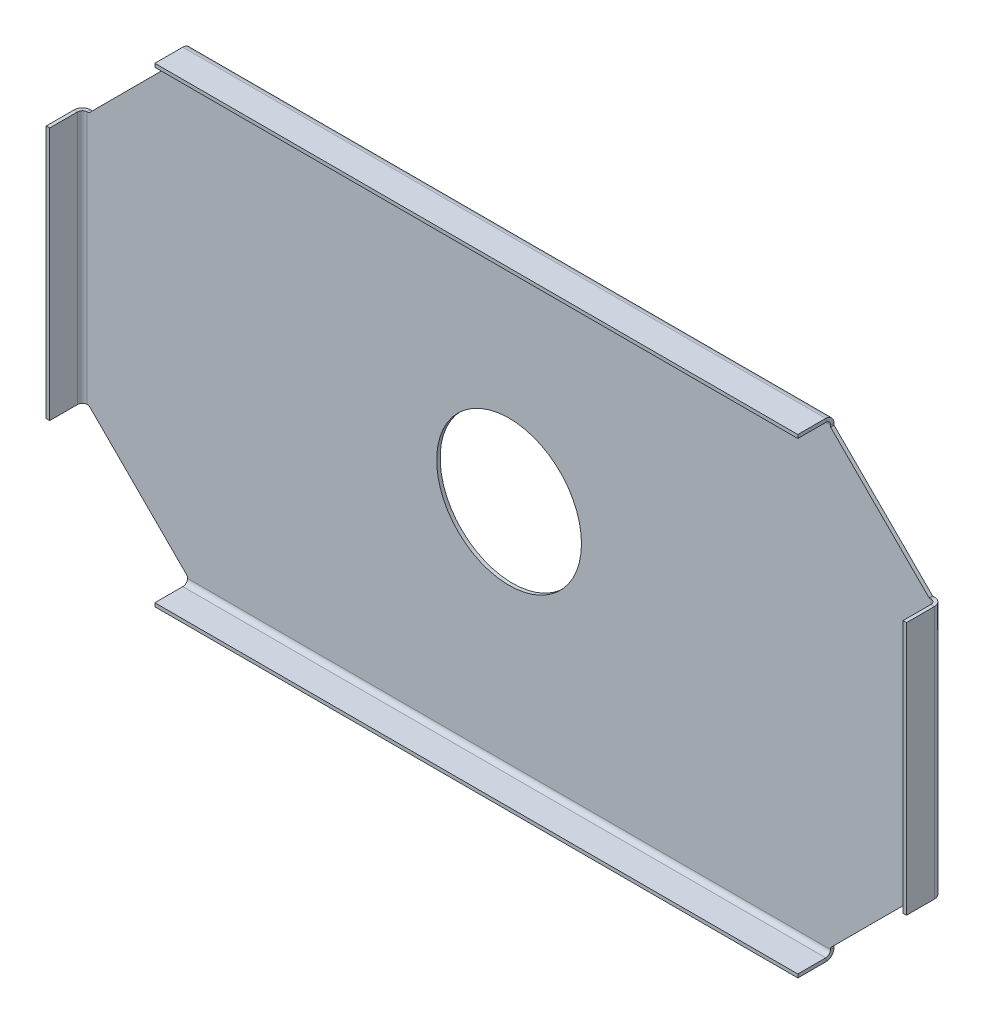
ISO-10303-21;
HEADER;
FILE_DESCRIPTION(('STEP AP214'),'2;1');
FILE_NAME('part.step','',(''),(''),'','','');
FILE_SCHEMA(('AUTOMOTIVE_DESIGN { 1 0 10303 214 1 1 1 1 }'));
ENDSEC;
DATA;
#1=APPLICATION_CONTEXT('core data for automotive mechanical design processes');
#2=APPLICATION_PROTOCOL_DEFINITION('international standard','automotive_design',2000,#1);
#3=PRODUCT_CONTEXT('',#1,'mechanical');
#4=PRODUCT('Part','Part','',(#3));
#5=PRODUCT_RELATED_PRODUCT_CATEGORY('part','',(#4));
#6=PRODUCT_DEFINITION_FORMATION('','',#4);
#7=PRODUCT_DEFINITION_CONTEXT('part definition',#1,'design');
#8=PRODUCT_DEFINITION('design','',#6,#7);
#9=PRODUCT_DEFINITION_SHAPE('','',#8);
#10=(LENGTH_UNIT() NAMED_UNIT(*) SI_UNIT(.MILLI.,.METRE.));
#11=(NAMED_UNIT(*) PLANE_ANGLE_UNIT() SI_UNIT($,.RADIAN.));
#12=(NAMED_UNIT(*) SI_UNIT($,.STERADIAN.) SOLID_ANGLE_UNIT());
#13=UNCERTAINTY_MEASURE_WITH_UNIT(LENGTH_MEASURE(1.E-05),#10,'distance_accuracy_value','');
#14=(GEOMETRIC_REPRESENTATION_CONTEXT(3) GLOBAL_UNCERTAINTY_ASSIGNED_CONTEXT((#13)) GLOBAL_UNIT_ASSIGNED_CONTEXT((#10,
#11,#12)) REPRESENTATION_CONTEXT('',''));
#15=CARTESIAN_POINT('',(0.,0.,0.));
#16=DIRECTION('',(0.,0.,1.));
#17=DIRECTION('',(1.,0.,0.));
#18=AXIS2_PLACEMENT_3D('',#15,#16,#17);
#19=CARTESIAN_POINT('',(0.,0.,-1.2192));
#20=DIRECTION('',(0.,0.,1.));
#21=DIRECTION('',(1.,0.,0.));
#22=AXIS2_PLACEMENT_3D('',#19,#20,#21);
#23=PLANE('',#22);
#24=CARTESIAN_POINT('',(0.,0.,-1.21920000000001));
#25=DIRECTION('',(0.,0.,1.));
#26=DIRECTION('',(1.,0.,0.));
#27=AXIS2_PLACEMENT_3D('',#24,#25,#26);
#28=CIRCLE('',#27,25.4);
#29=CARTESIAN_POINT('',(25.4,0.,-1.21920000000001));
#30=VERTEX_POINT('',#29);
#31=EDGE_CURVE('E1112',#30,#30,#28,.T.);
#32=ORIENTED_EDGE('',*,*,#31,.T.);
#33=EDGE_LOOP('',(#32));
#34=FACE_BOUND('',#33,.T.);
#35=DIRECTION('',(0.,-1.,0.));
#36=VECTOR('',#35,1.);
#37=CARTESIAN_POINT('',(-112.776,0.,-1.2192));
#38=LINE('',#37,#36);
#39=CARTESIAN_POINT('',(-112.776,-79.0448,-1.21920000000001));
#40=VERTEX_POINT('',#39);
#41=CARTESIAN_POINT('',(-112.776,-79.6544,-1.2192));
#42=VERTEX_POINT('',#41);
#43=EDGE_CURVE('E415',#40,#42,#38,.T.);
#44=ORIENTED_EDGE('',*,*,#43,.F.);
#45=DIRECTION('',(-0.707106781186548,0.707106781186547,0.));
#46=VECTOR('',#45,1.);
#47=CARTESIAN_POINT('',(-147.3708,-44.4499999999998,-1.21920000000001));
#48=LINE('',#47,#46);
#49=CARTESIAN_POINT('',(-147.3708,-44.4499999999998,-1.21920000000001));
#50=VERTEX_POINT('',#49);
#51=EDGE_CURVE('E437',#40,#50,#48,.T.);
#52=ORIENTED_EDGE('',*,*,#51,.T.);
#53=DIRECTION('',(1.,0.,0.));
#54=VECTOR('',#53,1.);
#55=CARTESIAN_POINT('',(0.,-44.4499999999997,-1.2192));
#56=LINE('',#55,#54);
#57=CARTESIAN_POINT('',(-147.9804,-44.4499999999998,-1.2192));
#58=VERTEX_POINT('',#57);
#59=EDGE_CURVE('E409',#58,#50,#56,.T.);
#60=ORIENTED_EDGE('',*,*,#59,.F.);
#61=DIRECTION('',(0.,-1.,0.));
#62=VECTOR('',#61,1.);
#63=CARTESIAN_POINT('',(-147.9804,-44.4499999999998,-1.2192));
#64=LINE('',#63,#62);
#65=CARTESIAN_POINT('',(-147.9804,44.4499999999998,-1.2192));
#66=VERTEX_POINT('',#65);
#67=EDGE_CURVE('E1210',#58,#66,#64,.F.);
#68=ORIENTED_EDGE('',*,*,#67,.T.);
#69=DIRECTION('',(-1.,0.,0.));
#70=VECTOR('',#69,1.);
#71=CARTESIAN_POINT('',(0.,44.4499999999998,-1.2192));
#72=LINE('',#71,#70);
#73=CARTESIAN_POINT('',(-147.3708,44.4499999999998,-1.21920000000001));
#74=VERTEX_POINT('',#73);
#75=EDGE_CURVE('E400',#74,#66,#72,.T.);
#76=ORIENTED_EDGE('',*,*,#75,.F.);
#77=DIRECTION('',(0.707106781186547,0.707106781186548,0.));
#78=VECTOR('',#77,1.);
#79=CARTESIAN_POINT('',(-147.3708,44.4499999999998,-1.21920000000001));
#80=LINE('',#79,#78);
#81=CARTESIAN_POINT('',(-112.776,79.0448,-1.21920000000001));
#82=VERTEX_POINT('',#81);
#83=EDGE_CURVE('E345',#74,#82,#80,.T.);
#84=ORIENTED_EDGE('',*,*,#83,.T.);
#85=DIRECTION('',(0.,-1.,0.));
#86=VECTOR('',#85,1.);
#87=CARTESIAN_POINT('',(-112.776,0.,-1.2192));
#88=LINE('',#87,#86);
#89=CARTESIAN_POINT('',(-112.776,79.6544000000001,-1.21919999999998));
#90=VERTEX_POINT('',#89);
#91=EDGE_CURVE('E394',#90,#82,#88,.T.);
#92=ORIENTED_EDGE('',*,*,#91,.F.);
#93=DIRECTION('',(-1.,0.,0.));
#94=VECTOR('',#93,1.);
#95=CARTESIAN_POINT('',(-112.776,79.6544000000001,-1.21919999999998));
#96=LINE('',#95,#94);
#97=CARTESIAN_POINT('',(112.776,79.6544000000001,-1.2192));
#98=VERTEX_POINT('',#97);
#99=EDGE_CURVE('E1157',#90,#98,#96,.F.);
#100=ORIENTED_EDGE('',*,*,#99,.T.);
#101=DIRECTION('',(0.,1.,0.));
#102=VECTOR('',#101,1.);
#103=CARTESIAN_POINT('',(112.776,0.,-1.2192));
#104=LINE('',#103,#102);
#105=CARTESIAN_POINT('',(112.776,79.0448000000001,-1.2192));
#106=VERTEX_POINT('',#105);
#107=EDGE_CURVE('E344',#106,#98,#104,.T.);
#108=ORIENTED_EDGE('',*,*,#107,.F.);
#109=DIRECTION('',(0.707106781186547,-0.707106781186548,0.));
#110=VECTOR('',#109,1.);
#111=CARTESIAN_POINT('',(112.776,79.0448,-1.21920000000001));
#112=LINE('',#111,#110);
#113=CARTESIAN_POINT('',(147.3708,44.4499999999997,-1.21920000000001));
#114=VERTEX_POINT('',#113);
#115=EDGE_CURVE('E330',#106,#114,#112,.T.);
#116=ORIENTED_EDGE('',*,*,#115,.T.);
#117=DIRECTION('',(-1.,0.,0.));
#118=VECTOR('',#117,1.);
#119=CARTESIAN_POINT('',(0.,44.4499999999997,-1.2192));
#120=LINE('',#119,#118);
#121=CARTESIAN_POINT('',(147.9804,44.4499999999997,-1.2192));
#122=VERTEX_POINT('',#121);
#123=EDGE_CURVE('E13',#122,#114,#120,.T.);
#124=ORIENTED_EDGE('',*,*,#123,.F.);
#125=DIRECTION('',(0.,1.,0.));
#126=VECTOR('',#125,1.);
#127=CARTESIAN_POINT('',(147.9804,44.4499999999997,-1.2192));
#128=LINE('',#127,#126);
#129=CARTESIAN_POINT('',(147.9804,-44.4499999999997,-1.2192));
#130=VERTEX_POINT('',#129);
#131=EDGE_CURVE('E361',#122,#130,#128,.F.);
#132=ORIENTED_EDGE('',*,*,#131,.T.);
#133=DIRECTION('',(1.,0.,0.));
#134=VECTOR('',#133,1.);
#135=CARTESIAN_POINT('',(0.,-44.4499999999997,-1.2192));
#136=LINE('',#135,#134);
#137=CARTESIAN_POINT('',(147.3708,-44.4499999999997,-1.21920000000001));
#138=VERTEX_POINT('',#137);
#139=EDGE_CURVE('E127',#138,#130,#136,.T.);
#140=ORIENTED_EDGE('',*,*,#139,.F.);
#141=DIRECTION('',(-0.707106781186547,-0.707106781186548,0.));
#142=VECTOR('',#141,1.);
#143=CARTESIAN_POINT('',(112.776,-79.0448,-1.21920000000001));
#144=LINE('',#143,#142);
#145=CARTESIAN_POINT('',(112.776,-79.0448,-1.21920000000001));
#146=VERTEX_POINT('',#145);
#147=EDGE_CURVE('E346',#138,#146,#144,.T.);
#148=ORIENTED_EDGE('',*,*,#147,.T.);
#149=DIRECTION('',(0.,1.,0.));
#150=VECTOR('',#149,1.);
#151=CARTESIAN_POINT('',(112.776,0.,-1.2192));
#152=LINE('',#151,#150);
#153=CARTESIAN_POINT('',(112.776,-79.6544,-1.21919999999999));
#154=VERTEX_POINT('',#153);
#155=EDGE_CURVE('E424',#154,#146,#152,.T.);
#156=ORIENTED_EDGE('',*,*,#155,.F.);
#157=DIRECTION('',(1.,0.,0.));
#158=VECTOR('',#157,1.);
#159=CARTESIAN_POINT('',(112.776,-79.6544,-1.21919999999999));
#160=LINE('',#159,#158);
#161=EDGE_CURVE('E456',#154,#42,#160,.F.);
#162=ORIENTED_EDGE('',*,*,#161,.T.);
#163=EDGE_LOOP('',(#44,#52,#60,#68,#76,#84,#92,#100,#108,#116,#124,#132,#140,#148,#156,#162));
#164=FACE_BOUND('',#163,.T.);
#165=ADVANCED_FACE('F118',(#34,#164),#23,.F.);
#166=CARTESIAN_POINT('',(0.,0.,0.));
#167=DIRECTION('',(0.,0.,1.));
#168=DIRECTION('',(1.,0.,0.));
#169=AXIS2_PLACEMENT_3D('',#166,#167,#168);
#170=PLANE('',#169);
#171=CARTESIAN_POINT('',(0.,0.,0.));
#172=DIRECTION('',(0.,0.,1.));
#173=DIRECTION('',(1.,0.,0.));
#174=AXIS2_PLACEMENT_3D('',#171,#172,#173);
#175=CIRCLE('',#174,25.4);
#176=CARTESIAN_POINT('',(25.4,0.,0.));
#177=VERTEX_POINT('',#176);
#178=EDGE_CURVE('E122',#177,#177,#175,.T.);
#179=ORIENTED_EDGE('',*,*,#178,.F.);
#180=EDGE_LOOP('',(#179));
#181=FACE_BOUND('',#180,.T.);
#182=DIRECTION('',(-0.707106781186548,0.707106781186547,0.));
#183=VECTOR('',#182,1.);
#184=CARTESIAN_POINT('',(-95.9103999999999,-95.9103999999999,0.));
#185=LINE('',#184,#183);
#186=CARTESIAN_POINT('',(-112.776,-79.0448,0.));
#187=VERTEX_POINT('',#186);
#188=CARTESIAN_POINT('',(-147.3708,-44.4499999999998,0.));
#189=VERTEX_POINT('',#188);
#190=EDGE_CURVE('E1122',#187,#189,#185,.T.);
#191=ORIENTED_EDGE('',*,*,#190,.F.);
#192=DIRECTION('',(0.,1.,0.));
#193=VECTOR('',#192,1.);
#194=CARTESIAN_POINT('',(-112.776,-79.6544,0.));
#195=LINE('',#194,#193);
#196=CARTESIAN_POINT('',(-112.776,-79.6544,0.));
#197=VERTEX_POINT('',#196);
#198=EDGE_CURVE('E417',#197,#187,#195,.T.);
#199=ORIENTED_EDGE('',*,*,#198,.F.);
#200=DIRECTION('',(1.,0.,0.));
#201=VECTOR('',#200,1.);
#202=CARTESIAN_POINT('',(112.776,-79.6544,0.));
#203=LINE('',#202,#201);
#204=CARTESIAN_POINT('',(112.776,-79.6544,0.));
#205=VERTEX_POINT('',#204);
#206=EDGE_CURVE('E470',#205,#197,#203,.F.);
#207=ORIENTED_EDGE('',*,*,#206,.F.);
#208=DIRECTION('',(0.,-1.,0.));
#209=VECTOR('',#208,1.);
#210=CARTESIAN_POINT('',(112.776,-79.0448,0.));
#211=LINE('',#210,#209);
#212=CARTESIAN_POINT('',(112.776,-79.0448,0.));
#213=VERTEX_POINT('',#212);
#214=EDGE_CURVE('E413',#213,#205,#211,.T.);
#215=ORIENTED_EDGE('',*,*,#214,.F.);
#216=DIRECTION('',(-0.707106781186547,-0.707106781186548,0.));
#217=VECTOR('',#216,1.);
#218=CARTESIAN_POINT('',(95.9103999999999,-95.9103999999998,0.));
#219=LINE('',#218,#217);
#220=CARTESIAN_POINT('',(147.3708,-44.4499999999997,0.));
#221=VERTEX_POINT('',#220);
#222=EDGE_CURVE('E1124',#221,#213,#219,.T.);
#223=ORIENTED_EDGE('',*,*,#222,.F.);
#224=DIRECTION('',(-1.,0.,0.));
#225=VECTOR('',#224,1.);
#226=CARTESIAN_POINT('',(147.9804,-44.4499999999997,0.));
#227=LINE('',#226,#225);
#228=CARTESIAN_POINT('',(147.9804,-44.4499999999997,0.));
#229=VERTEX_POINT('',#228);
#230=EDGE_CURVE('E337',#229,#221,#227,.T.);
#231=ORIENTED_EDGE('',*,*,#230,.F.);
#232=DIRECTION('',(0.,1.,0.));
#233=VECTOR('',#232,1.);
#234=CARTESIAN_POINT('',(147.9804,44.4499999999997,0.));
#235=LINE('',#234,#233);
#236=CARTESIAN_POINT('',(147.9804,44.4499999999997,0.));
#237=VERTEX_POINT('',#236);
#238=EDGE_CURVE('E374',#237,#229,#235,.F.);
#239=ORIENTED_EDGE('',*,*,#238,.F.);
#240=DIRECTION('',(1.,0.,0.));
#241=VECTOR('',#240,1.);
#242=CARTESIAN_POINT('',(147.3708,44.4499999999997,0.));
#243=LINE('',#242,#241);
#244=CARTESIAN_POINT('',(147.3708,44.4499999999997,0.));
#245=VERTEX_POINT('',#244);
#246=EDGE_CURVE('E336',#245,#237,#243,.T.);
#247=ORIENTED_EDGE('',*,*,#246,.F.);
#248=DIRECTION('',(0.707106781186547,-0.707106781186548,0.));
#249=VECTOR('',#248,1.);
#250=CARTESIAN_POINT('',(95.9104,95.9103999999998,0.));
#251=LINE('',#250,#249);
#252=CARTESIAN_POINT('',(112.776,79.0448,0.));
#253=VERTEX_POINT('',#252);
#254=EDGE_CURVE('E333',#253,#245,#251,.T.);
#255=ORIENTED_EDGE('',*,*,#254,.F.);
#256=DIRECTION('',(0.,-1.,0.));
#257=VECTOR('',#256,1.);
#258=CARTESIAN_POINT('',(112.776,79.6544,0.));
#259=LINE('',#258,#257);
#260=CARTESIAN_POINT('',(112.776,79.6544,0.));
#261=VERTEX_POINT('',#260);
#262=EDGE_CURVE('E388',#261,#253,#259,.T.);
#263=ORIENTED_EDGE('',*,*,#262,.F.);
#264=DIRECTION('',(-1.,0.,0.));
#265=VECTOR('',#264,1.);
#266=CARTESIAN_POINT('',(-112.776,79.6544,0.));
#267=LINE('',#266,#265);
#268=CARTESIAN_POINT('',(-112.776,79.6544,0.));
#269=VERTEX_POINT('',#268);
#270=EDGE_CURVE('E1169',#269,#261,#267,.F.);
#271=ORIENTED_EDGE('',*,*,#270,.F.);
#272=DIRECTION('',(0.,1.,0.));
#273=VECTOR('',#272,1.);
#274=CARTESIAN_POINT('',(-112.776,79.0448,0.));
#275=LINE('',#274,#273);
#276=CARTESIAN_POINT('',(-112.776,79.0448,0.));
#277=VERTEX_POINT('',#276);
#278=EDGE_CURVE('E385',#277,#269,#275,.T.);
#279=ORIENTED_EDGE('',*,*,#278,.F.);
#280=DIRECTION('',(0.707106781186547,0.707106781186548,0.));
#281=VECTOR('',#280,1.);
#282=CARTESIAN_POINT('',(-95.9103999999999,95.9103999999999,0.));
#283=LINE('',#282,#281);
#284=CARTESIAN_POINT('',(-147.3708,44.4499999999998,0.));
#285=VERTEX_POINT('',#284);
#286=EDGE_CURVE('E1120',#285,#277,#283,.T.);
#287=ORIENTED_EDGE('',*,*,#286,.F.);
#288=DIRECTION('',(1.,0.,0.));
#289=VECTOR('',#288,1.);
#290=CARTESIAN_POINT('',(-147.9804,44.4499999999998,0.));
#291=LINE('',#290,#289);
#292=CARTESIAN_POINT('',(-147.9804,44.4499999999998,0.));
#293=VERTEX_POINT('',#292);
#294=EDGE_CURVE('E402',#293,#285,#291,.T.);
#295=ORIENTED_EDGE('',*,*,#294,.F.);
#296=DIRECTION('',(0.,-1.,0.));
#297=VECTOR('',#296,1.);
#298=CARTESIAN_POINT('',(-147.9804,-44.4499999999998,0.));
#299=LINE('',#298,#297);
#300=CARTESIAN_POINT('',(-147.9804,-44.4499999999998,0.));
#301=VERTEX_POINT('',#300);
#302=EDGE_CURVE('E1223',#301,#293,#299,.F.);
#303=ORIENTED_EDGE('',*,*,#302,.F.);
#304=DIRECTION('',(-1.,0.,0.));
#305=VECTOR('',#304,1.);
#306=CARTESIAN_POINT('',(-147.3708,-44.4499999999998,0.));
#307=LINE('',#306,#305);
#308=EDGE_CURVE('E398',#189,#301,#307,.T.);
#309=ORIENTED_EDGE('',*,*,#308,.F.);
#310=EDGE_LOOP('',(#191,#199,#207,#215,#223,#231,#239,#247,#255,#263,#271,#279,#287,#295,#303,#309));
#311=FACE_BOUND('',#310,.T.);
#312=ADVANCED_FACE('F120',(#181,#311),#170,.T.);
#313=CARTESIAN_POINT('',(147.3708,44.4499999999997,0.));
#314=DIRECTION('',(0.,1.,0.));
#315=DIRECTION('',(0.,0.,1.));
#316=AXIS2_PLACEMENT_3D('',#313,#314,#315);
#317=PLANE('',#316);
#318=DIRECTION('',(0.,0.,-1.));
#319=VECTOR('',#318,1.);
#320=CARTESIAN_POINT('',(147.9804,44.4499999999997,0.));
#321=LINE('',#320,#319);
#322=EDGE_CURVE('E350',#237,#122,#321,.T.);
#323=ORIENTED_EDGE('',*,*,#322,.T.);
#324=ORIENTED_EDGE('',*,*,#123,.T.);
#325=DIRECTION('',(0.,0.,-1.));
#326=VECTOR('',#325,1.);
#327=CARTESIAN_POINT('',(147.3708,44.4499999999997,0.));
#328=LINE('',#327,#326);
#329=EDGE_CURVE('E327',#245,#114,#328,.T.);
#330=ORIENTED_EDGE('',*,*,#329,.F.);
#331=ORIENTED_EDGE('',*,*,#246,.T.);
#332=EDGE_LOOP('',(#323,#324,#330,#331));
#333=FACE_BOUND('',#332,.T.);
#334=ADVANCED_FACE('F348',(#333),#317,.T.);
#335=CARTESIAN_POINT('',(147.9804,-44.4499999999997,0.));
#336=DIRECTION('',(0.,-1.,0.));
#337=DIRECTION('',(0.,0.,-1.));
#338=AXIS2_PLACEMENT_3D('',#335,#336,#337);
#339=PLANE('',#338);
#340=DIRECTION('',(0.,0.,-1.));
#341=VECTOR('',#340,1.);
#342=CARTESIAN_POINT('',(147.3708,-44.4499999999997,0.));
#343=LINE('',#342,#341);
#344=EDGE_CURVE('E427',#221,#138,#343,.T.);
#345=ORIENTED_EDGE('',*,*,#344,.T.);
#346=ORIENTED_EDGE('',*,*,#139,.T.);
#347=DIRECTION('',(0.,0.,-1.));
#348=VECTOR('',#347,1.);
#349=CARTESIAN_POINT('',(147.9804,-44.4499999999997,0.));
#350=LINE('',#349,#348);
#351=EDGE_CURVE('E138',#229,#130,#350,.T.);
#352=ORIENTED_EDGE('',*,*,#351,.F.);
#353=ORIENTED_EDGE('',*,*,#230,.T.);
#354=EDGE_LOOP('',(#345,#346,#352,#353));
#355=FACE_BOUND('',#354,.T.);
#356=ADVANCED_FACE('F431',(#355),#339,.T.);
#357=CARTESIAN_POINT('',(112.776,-79.0448,0.));
#358=DIRECTION('',(1.,0.,0.));
#359=DIRECTION('',(0.,0.,-1.));
#360=AXIS2_PLACEMENT_3D('',#357,#358,#359);
#361=PLANE('',#360);
#362=DIRECTION('',(0.,0.,-1.));
#363=VECTOR('',#362,1.);
#364=CARTESIAN_POINT('',(112.776,-79.6544,0.));
#365=LINE('',#364,#363);
#366=EDGE_CURVE('E444',#205,#154,#365,.T.);
#367=ORIENTED_EDGE('',*,*,#366,.T.);
#368=ORIENTED_EDGE('',*,*,#155,.T.);
#369=DIRECTION('',(0.,0.,-1.));
#370=VECTOR('',#369,1.);
#371=CARTESIAN_POINT('',(112.776,-79.0448,0.));
#372=LINE('',#371,#370);
#373=EDGE_CURVE('E416',#213,#146,#372,.T.);
#374=ORIENTED_EDGE('',*,*,#373,.F.);
#375=ORIENTED_EDGE('',*,*,#214,.T.);
#376=EDGE_LOOP('',(#367,#368,#374,#375));
#377=FACE_BOUND('',#376,.T.);
#378=ADVANCED_FACE('F441',(#377),#361,.T.);
#379=CARTESIAN_POINT('',(-112.776,-79.6544,0.));
#380=DIRECTION('',(-1.,0.,0.));
#381=DIRECTION('',(0.,0.,1.));
#382=AXIS2_PLACEMENT_3D('',#379,#380,#381);
#383=PLANE('',#382);
#384=DIRECTION('',(0.,0.,-1.));
#385=VECTOR('',#384,1.);
#386=CARTESIAN_POINT('',(-112.776,-79.0448,0.));
#387=LINE('',#386,#385);
#388=EDGE_CURVE('E412',#187,#40,#387,.T.);
#389=ORIENTED_EDGE('',*,*,#388,.T.);
#390=ORIENTED_EDGE('',*,*,#43,.T.);
#391=DIRECTION('',(0.,0.,-1.));
#392=VECTOR('',#391,1.);
#393=CARTESIAN_POINT('',(-112.776,-79.6544,0.));
#394=LINE('',#393,#392);
#395=EDGE_CURVE('E451',#197,#42,#394,.T.);
#396=ORIENTED_EDGE('',*,*,#395,.F.);
#397=ORIENTED_EDGE('',*,*,#198,.T.);
#398=EDGE_LOOP('',(#389,#390,#396,#397));
#399=FACE_BOUND('',#398,.T.);
#400=ADVANCED_FACE('F552',(#399),#383,.T.);
#401=CARTESIAN_POINT('',(-147.3708,-44.4499999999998,0.));
#402=DIRECTION('',(0.,-1.,0.));
#403=DIRECTION('',(0.,0.,-1.));
#404=AXIS2_PLACEMENT_3D('',#401,#402,#403);
#405=PLANE('',#404);
#406=DIRECTION('',(0.,0.,-1.));
#407=VECTOR('',#406,1.);
#408=CARTESIAN_POINT('',(-147.9804,-44.4499999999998,0.));
#409=LINE('',#408,#407);
#410=EDGE_CURVE('E1217',#301,#58,#409,.T.);
#411=ORIENTED_EDGE('',*,*,#410,.T.);
#412=ORIENTED_EDGE('',*,*,#59,.T.);
#413=DIRECTION('',(0.,0.,-1.));
#414=VECTOR('',#413,1.);
#415=CARTESIAN_POINT('',(-147.3708,-44.4499999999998,0.));
#416=LINE('',#415,#414);
#417=EDGE_CURVE('E401',#189,#50,#416,.T.);
#418=ORIENTED_EDGE('',*,*,#417,.F.);
#419=ORIENTED_EDGE('',*,*,#308,.T.);
#420=EDGE_LOOP('',(#411,#412,#418,#419));
#421=FACE_BOUND('',#420,.T.);
#422=ADVANCED_FACE('F555',(#421),#405,.T.);
#423=CARTESIAN_POINT('',(-147.9804,44.4499999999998,0.));
#424=DIRECTION('',(0.,1.,0.));
#425=DIRECTION('',(0.,0.,1.));
#426=AXIS2_PLACEMENT_3D('',#423,#424,#425);
#427=PLANE('',#426);
#428=DIRECTION('',(0.,0.,-1.));
#429=VECTOR('',#428,1.);
#430=CARTESIAN_POINT('',(-147.3708,44.4499999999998,0.));
#431=LINE('',#430,#429);
#432=EDGE_CURVE('E397',#285,#74,#431,.T.);
#433=ORIENTED_EDGE('',*,*,#432,.T.);
#434=ORIENTED_EDGE('',*,*,#75,.T.);
#435=DIRECTION('',(0.,0.,-1.));
#436=VECTOR('',#435,1.);
#437=CARTESIAN_POINT('',(-147.9804,44.4499999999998,0.));
#438=LINE('',#437,#436);
#439=EDGE_CURVE('E1228',#293,#66,#438,.T.);
#440=ORIENTED_EDGE('',*,*,#439,.F.);
#441=ORIENTED_EDGE('',*,*,#294,.T.);
#442=EDGE_LOOP('',(#433,#434,#440,#441));
#443=FACE_BOUND('',#442,.T.);
#444=ADVANCED_FACE('F559',(#443),#427,.T.);
#445=CARTESIAN_POINT('',(-112.776,79.0448,0.));
#446=DIRECTION('',(-1.,0.,0.));
#447=DIRECTION('',(0.,0.,1.));
#448=AXIS2_PLACEMENT_3D('',#445,#446,#447);
#449=PLANE('',#448);
#450=DIRECTION('',(0.,0.,-1.));
#451=VECTOR('',#450,1.);
#452=CARTESIAN_POINT('',(-112.776,79.6544,0.));
#453=LINE('',#452,#451);
#454=EDGE_CURVE('E1163',#269,#90,#453,.T.);
#455=ORIENTED_EDGE('',*,*,#454,.T.);
#456=ORIENTED_EDGE('',*,*,#91,.T.);
#457=DIRECTION('',(0.,0.,-1.));
#458=VECTOR('',#457,1.);
#459=CARTESIAN_POINT('',(-112.776,79.0448,0.));
#460=LINE('',#459,#458);
#461=EDGE_CURVE('E387',#277,#82,#460,.T.);
#462=ORIENTED_EDGE('',*,*,#461,.F.);
#463=ORIENTED_EDGE('',*,*,#278,.T.);
#464=EDGE_LOOP('',(#455,#456,#462,#463));
#465=FACE_BOUND('',#464,.T.);
#466=ADVANCED_FACE('F563',(#465),#449,.T.);
#467=CARTESIAN_POINT('',(112.776,79.6544,0.));
#468=DIRECTION('',(1.,0.,0.));
#469=DIRECTION('',(0.,0.,-1.));
#470=AXIS2_PLACEMENT_3D('',#467,#468,#469);
#471=PLANE('',#470);
#472=DIRECTION('',(0.,0.,-1.));
#473=VECTOR('',#472,1.);
#474=CARTESIAN_POINT('',(112.776,79.0448,0.));
#475=LINE('',#474,#473);
#476=EDGE_CURVE('E383',#253,#106,#475,.T.);
#477=ORIENTED_EDGE('',*,*,#476,.T.);
#478=ORIENTED_EDGE('',*,*,#107,.T.);
#479=DIRECTION('',(0.,0.,-1.));
#480=VECTOR('',#479,1.);
#481=CARTESIAN_POINT('',(112.776,79.6544,0.));
#482=LINE('',#481,#480);
#483=EDGE_CURVE('E1174',#261,#98,#482,.T.);
#484=ORIENTED_EDGE('',*,*,#483,.F.);
#485=ORIENTED_EDGE('',*,*,#262,.T.);
#486=EDGE_LOOP('',(#477,#478,#484,#485));
#487=FACE_BOUND('',#486,.T.);
#488=ADVANCED_FACE('F567',(#487),#471,.T.);
#489=CARTESIAN_POINT('',(147.9804,-44.4499999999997,1.6764));
#490=DIRECTION('',(0.,-1.,0.));
#491=DIRECTION('',(0.,0.,-1.));
#492=AXIS2_PLACEMENT_3D('',#489,#490,#491);
#493=PLANE('',#492);
#494=DIRECTION('',(-1.,0.,0.));
#495=VECTOR('',#494,1.);
#496=CARTESIAN_POINT('',(150.876,-44.4499999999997,1.67639999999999));
#497=LINE('',#496,#495);
#498=CARTESIAN_POINT('',(149.6568,-44.4499999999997,1.67639999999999));
#499=VERTEX_POINT('',#498);
#500=CARTESIAN_POINT('',(150.876,-44.4499999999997,1.67639999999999));
#501=VERTEX_POINT('',#500);
#502=EDGE_CURVE('E479',#499,#501,#497,.F.);
#503=ORIENTED_EDGE('',*,*,#502,.F.);
#504=CARTESIAN_POINT('',(147.9804,-44.4499999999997,1.6764));
#505=DIRECTION('',(0.,1.,0.));
#506=DIRECTION('',(0.,0.,1.));
#507=AXIS2_PLACEMENT_3D('',#504,#505,#506);
#508=CIRCLE('',#507,1.67639999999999);
#509=EDGE_CURVE('E371',#229,#499,#508,.F.);
#510=ORIENTED_EDGE('',*,*,#509,.F.);
#511=ORIENTED_EDGE('',*,*,#351,.T.);
#512=CARTESIAN_POINT('',(147.9804,-44.4499999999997,1.6764));
#513=DIRECTION('',(0.,1.,0.));
#514=DIRECTION('',(0.,0.,1.));
#515=AXIS2_PLACEMENT_3D('',#512,#513,#514);
#516=CIRCLE('',#515,2.89559999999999);
#517=EDGE_CURVE('E357',#130,#501,#516,.F.);
#518=ORIENTED_EDGE('',*,*,#517,.T.);
#519=EDGE_LOOP('',(#503,#510,#511,#518));
#520=FACE_BOUND('',#519,.T.);
#521=ADVANCED_FACE('F571',(#520),#493,.T.);
#522=CARTESIAN_POINT('',(147.9804,44.4499999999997,1.6764));
#523=DIRECTION('',(0.,-1.,0.));
#524=DIRECTION('',(0.,0.,-1.));
#525=AXIS2_PLACEMENT_3D('',#522,#523,#524);
#526=PLANE('',#525);
#527=CARTESIAN_POINT('',(147.9804,44.4499999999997,1.6764));
#528=DIRECTION('',(0.,1.,0.));
#529=DIRECTION('',(0.,0.,1.));
#530=AXIS2_PLACEMENT_3D('',#527,#528,#529);
#531=CIRCLE('',#530,1.67639999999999);
#532=CARTESIAN_POINT('',(149.6568,44.4499999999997,1.67639999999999));
#533=VERTEX_POINT('',#532);
#534=EDGE_CURVE('E380',#533,#237,#531,.T.);
#535=ORIENTED_EDGE('',*,*,#534,.F.);
#536=DIRECTION('',(-1.,0.,0.));
#537=VECTOR('',#536,1.);
#538=CARTESIAN_POINT('',(149.6568,44.4499999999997,1.67639999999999));
#539=LINE('',#538,#537);
#540=CARTESIAN_POINT('',(150.876,44.4499999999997,1.67639999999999));
#541=VERTEX_POINT('',#540);
#542=EDGE_CURVE('E369',#533,#541,#539,.F.);
#543=ORIENTED_EDGE('',*,*,#542,.T.);
#544=CARTESIAN_POINT('',(147.9804,44.4499999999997,1.6764));
#545=DIRECTION('',(0.,1.,0.));
#546=DIRECTION('',(0.,0.,1.));
#547=AXIS2_PLACEMENT_3D('',#544,#545,#546);
#548=CIRCLE('',#547,2.89559999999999);
#549=EDGE_CURVE('E363',#541,#122,#548,.T.);
#550=ORIENTED_EDGE('',*,*,#549,.T.);
#551=ORIENTED_EDGE('',*,*,#322,.F.);
#552=EDGE_LOOP('',(#535,#543,#550,#551));
#553=FACE_BOUND('',#552,.T.);
#554=ADVANCED_FACE('F367',(#553),#526,.F.);
#555=CARTESIAN_POINT('',(147.9804,44.4499999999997,1.6764));
#556=DIRECTION('',(0.,1.,0.));
#557=DIRECTION('',(1.,0.,0.));
#558=AXIS2_PLACEMENT_3D('',#555,#556,#557);
#559=CYLINDRICAL_SURFACE('',#558,2.89559999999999);
#560=ORIENTED_EDGE('',*,*,#131,.F.);
#561=ORIENTED_EDGE('',*,*,#549,.F.);
#562=DIRECTION('',(0.,1.,0.));
#563=VECTOR('',#562,1.);
#564=CARTESIAN_POINT('',(150.876,-44.4499999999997,1.67639999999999));
#565=LINE('',#564,#563);
#566=EDGE_CURVE('E500',#541,#501,#565,.F.);
#567=ORIENTED_EDGE('',*,*,#566,.T.);
#568=ORIENTED_EDGE('',*,*,#517,.F.);
#569=EDGE_LOOP('',(#560,#561,#567,#568));
#570=FACE_BOUND('',#569,.T.);
#571=ADVANCED_FACE('F362',(#570),#559,.T.);
#572=CARTESIAN_POINT('',(147.9804,44.4499999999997,1.6764));
#573=DIRECTION('',(0.,1.,0.));
#574=DIRECTION('',(1.,0.,0.));
#575=AXIS2_PLACEMENT_3D('',#572,#573,#574);
#576=CYLINDRICAL_SURFACE('',#575,1.67639999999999);
#577=ORIENTED_EDGE('',*,*,#238,.T.);
#578=ORIENTED_EDGE('',*,*,#509,.T.);
#579=DIRECTION('',(0.,1.,0.));
#580=VECTOR('',#579,1.);
#581=CARTESIAN_POINT('',(149.6568,-44.4499999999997,1.67639999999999));
#582=LINE('',#581,#580);
#583=EDGE_CURVE('E503',#499,#533,#582,.T.);
#584=ORIENTED_EDGE('',*,*,#583,.T.);
#585=ORIENTED_EDGE('',*,*,#534,.T.);
#586=EDGE_LOOP('',(#577,#578,#584,#585));
#587=FACE_BOUND('',#586,.T.);
#588=ADVANCED_FACE('F526',(#587),#576,.F.);
#589=CARTESIAN_POINT('',(150.876,-44.4499999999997,0.));
#590=DIRECTION('',(0.,1.,0.));
#591=DIRECTION('',(0.,0.,1.));
#592=AXIS2_PLACEMENT_3D('',#589,#590,#591);
#593=PLANE('',#592);
#594=ORIENTED_EDGE('',*,*,#502,.T.);
#595=DIRECTION('',(0.,0.,-1.));
#596=VECTOR('',#595,1.);
#597=CARTESIAN_POINT('',(150.876,-44.4499999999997,-3.69009290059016E-13));
#598=LINE('',#597,#596);
#599=CARTESIAN_POINT('',(150.876,-44.4499999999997,11.4808));
#600=VERTEX_POINT('',#599);
#601=EDGE_CURVE('E490',#600,#501,#598,.T.);
#602=ORIENTED_EDGE('',*,*,#601,.F.);
#603=DIRECTION('',(-1.,0.,0.));
#604=VECTOR('',#603,1.);
#605=CARTESIAN_POINT('',(150.876,-44.4499999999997,11.4808));
#606=LINE('',#605,#604);
#607=CARTESIAN_POINT('',(149.6568,-44.4499999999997,11.4808));
#608=VERTEX_POINT('',#607);
#609=EDGE_CURVE('E483',#600,#608,#606,.T.);
#610=ORIENTED_EDGE('',*,*,#609,.T.);
#611=DIRECTION('',(0.,0.,1.));
#612=VECTOR('',#611,1.);
#613=CARTESIAN_POINT('',(149.6568,-44.4499999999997,0.));
#614=LINE('',#613,#612);
#615=EDGE_CURVE('E497',#608,#499,#614,.F.);
#616=ORIENTED_EDGE('',*,*,#615,.T.);
#617=EDGE_LOOP('',(#594,#602,#610,#616));
#618=FACE_BOUND('',#617,.T.);
#619=ADVANCED_FACE('F508',(#618),#593,.F.);
#620=CARTESIAN_POINT('',(150.876,44.4499999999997,11.4808));
#621=DIRECTION('',(0.,-1.,0.));
#622=DIRECTION('',(0.,0.,-1.));
#623=AXIS2_PLACEMENT_3D('',#620,#621,#622);
#624=PLANE('',#623);
#625=ORIENTED_EDGE('',*,*,#542,.F.);
#626=DIRECTION('',(0.,0.,-1.));
#627=VECTOR('',#626,1.);
#628=CARTESIAN_POINT('',(149.6568,44.4499999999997,11.4808));
#629=LINE('',#628,#627);
#630=CARTESIAN_POINT('',(149.6568,44.4499999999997,11.4808));
#631=VERTEX_POINT('',#630);
#632=EDGE_CURVE('E495',#533,#631,#629,.F.);
#633=ORIENTED_EDGE('',*,*,#632,.T.);
#634=DIRECTION('',(-1.,0.,0.));
#635=VECTOR('',#634,1.);
#636=CARTESIAN_POINT('',(150.876,44.4499999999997,11.4808));
#637=LINE('',#636,#635);
#638=CARTESIAN_POINT('',(150.876,44.4499999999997,11.4808));
#639=VERTEX_POINT('',#638);
#640=EDGE_CURVE('E382',#639,#631,#637,.T.);
#641=ORIENTED_EDGE('',*,*,#640,.F.);
#642=DIRECTION('',(0.,0.,1.));
#643=VECTOR('',#642,1.);
#644=CARTESIAN_POINT('',(150.876,44.4499999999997,-3.69009290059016E-13));
#645=LINE('',#644,#643);
#646=EDGE_CURVE('E488',#541,#639,#645,.T.);
#647=ORIENTED_EDGE('',*,*,#646,.F.);
#648=EDGE_LOOP('',(#625,#633,#641,#647));
#649=FACE_BOUND('',#648,.T.);
#650=ADVANCED_FACE('F528',(#649),#624,.F.);
#651=CARTESIAN_POINT('',(150.876,0.,-3.69009290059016E-13));
#652=DIRECTION('',(-1.,0.,0.));
#653=DIRECTION('',(0.,0.,1.));
#654=AXIS2_PLACEMENT_3D('',#651,#652,#653);
#655=PLANE('',#654);
#656=ORIENTED_EDGE('',*,*,#566,.F.);
#657=ORIENTED_EDGE('',*,*,#646,.T.);
#658=DIRECTION('',(0.,-1.,0.));
#659=VECTOR('',#658,1.);
#660=CARTESIAN_POINT('',(150.876,0.,11.4808));
#661=LINE('',#660,#659);
#662=EDGE_CURVE('E486',#639,#600,#661,.T.);
#663=ORIENTED_EDGE('',*,*,#662,.T.);
#664=ORIENTED_EDGE('',*,*,#601,.T.);
#665=EDGE_LOOP('',(#656,#657,#663,#664));
#666=FACE_BOUND('',#665,.T.);
#667=ADVANCED_FACE('F513',(#666),#655,.F.);
#668=CARTESIAN_POINT('',(149.6568,0.,-3.64752476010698E-13));
#669=DIRECTION('',(-1.,0.,0.));
#670=DIRECTION('',(0.,0.,1.));
#671=AXIS2_PLACEMENT_3D('',#668,#669,#670);
#672=PLANE('',#671);
#673=ORIENTED_EDGE('',*,*,#632,.F.);
#674=ORIENTED_EDGE('',*,*,#583,.F.);
#675=ORIENTED_EDGE('',*,*,#615,.F.);
#676=DIRECTION('',(0.,1.,0.));
#677=VECTOR('',#676,1.);
#678=CARTESIAN_POINT('',(149.6568,-44.4499999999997,11.4808));
#679=LINE('',#678,#677);
#680=EDGE_CURVE('E493',#631,#608,#679,.F.);
#681=ORIENTED_EDGE('',*,*,#680,.F.);
#682=EDGE_LOOP('',(#673,#674,#675,#681));
#683=FACE_BOUND('',#682,.T.);
#684=ADVANCED_FACE('F524',(#683),#672,.T.);
#685=CARTESIAN_POINT('',(150.876,-44.4499999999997,11.4808));
#686=DIRECTION('',(0.,0.,-1.));
#687=DIRECTION('',(-1.,0.,0.));
#688=AXIS2_PLACEMENT_3D('',#685,#686,#687);
#689=PLANE('',#688);
#690=ORIENTED_EDGE('',*,*,#680,.T.);
#691=ORIENTED_EDGE('',*,*,#609,.F.);
#692=ORIENTED_EDGE('',*,*,#662,.F.);
#693=ORIENTED_EDGE('',*,*,#640,.T.);
#694=EDGE_LOOP('',(#690,#691,#692,#693));
#695=FACE_BOUND('',#694,.T.);
#696=ADVANCED_FACE('F519',(#695),#689,.F.);
#697=CARTESIAN_POINT('',(-112.776,-79.6544,1.6764));
#698=DIRECTION('',(-1.,0.,0.));
#699=DIRECTION('',(0.,0.,1.));
#700=AXIS2_PLACEMENT_3D('',#697,#698,#699);
#701=PLANE('',#700);
#702=DIRECTION('',(0.,1.,0.));
#703=VECTOR('',#702,1.);
#704=CARTESIAN_POINT('',(-112.776,-82.55,1.67639999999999));
#705=LINE('',#704,#703);
#706=CARTESIAN_POINT('',(-112.776,-81.3308,1.67639999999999));
#707=VERTEX_POINT('',#706);
#708=CARTESIAN_POINT('',(-112.776,-82.55,1.67639999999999));
#709=VERTEX_POINT('',#708);
#710=EDGE_CURVE('E1231',#707,#709,#705,.F.);
#711=ORIENTED_EDGE('',*,*,#710,.F.);
#712=CARTESIAN_POINT('',(-112.776,-79.6544,1.6764));
#713=DIRECTION('',(1.,0.,0.));
#714=DIRECTION('',(0.,0.,-1.));
#715=AXIS2_PLACEMENT_3D('',#712,#713,#714);
#716=CIRCLE('',#715,1.67640000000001);
#717=EDGE_CURVE('E467',#197,#707,#716,.F.);
#718=ORIENTED_EDGE('',*,*,#717,.F.);
#719=ORIENTED_EDGE('',*,*,#395,.T.);
#720=CARTESIAN_POINT('',(-112.776,-79.6544,1.6764));
#721=DIRECTION('',(1.,0.,0.));
#722=DIRECTION('',(0.,0.,-1.));
#723=AXIS2_PLACEMENT_3D('',#720,#721,#722);
#724=CIRCLE('',#723,2.89560000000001);
#725=EDGE_CURVE('E452',#42,#709,#724,.F.);
#726=ORIENTED_EDGE('',*,*,#725,.T.);
#727=EDGE_LOOP('',(#711,#718,#719,#726));
#728=FACE_BOUND('',#727,.T.);
#729=ADVANCED_FACE('F623',(#728),#701,.T.);
#730=CARTESIAN_POINT('',(112.776,-79.6544,1.67640000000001));
#731=DIRECTION('',(-1.,0.,0.));
#732=DIRECTION('',(0.,0.,1.));
#733=AXIS2_PLACEMENT_3D('',#730,#731,#732);
#734=PLANE('',#733);
#735=CARTESIAN_POINT('',(112.776,-79.6544,1.67640000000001));
#736=DIRECTION('',(1.,0.,0.));
#737=DIRECTION('',(0.,0.,-1.));
#738=AXIS2_PLACEMENT_3D('',#735,#736,#737);
#739=CIRCLE('',#738,1.67640000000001);
#740=CARTESIAN_POINT('',(112.776,-81.3308,1.67640000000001));
#741=VERTEX_POINT('',#740);
#742=EDGE_CURVE('E476',#741,#205,#739,.T.);
#743=ORIENTED_EDGE('',*,*,#742,.F.);
#744=DIRECTION('',(0.,1.,0.));
#745=VECTOR('',#744,1.);
#746=CARTESIAN_POINT('',(112.776,-81.3308,1.67640000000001));
#747=LINE('',#746,#745);
#748=CARTESIAN_POINT('',(112.776,-82.55,1.6764));
#749=VERTEX_POINT('',#748);
#750=EDGE_CURVE('E465',#741,#749,#747,.F.);
#751=ORIENTED_EDGE('',*,*,#750,.T.);
#752=CARTESIAN_POINT('',(112.776,-79.6544,1.67640000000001));
#753=DIRECTION('',(1.,0.,0.));
#754=DIRECTION('',(0.,0.,-1.));
#755=AXIS2_PLACEMENT_3D('',#752,#753,#754);
#756=CIRCLE('',#755,2.89560000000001);
#757=EDGE_CURVE('E458',#749,#154,#756,.T.);
#758=ORIENTED_EDGE('',*,*,#757,.T.);
#759=ORIENTED_EDGE('',*,*,#366,.F.);
#760=EDGE_LOOP('',(#743,#751,#758,#759));
#761=FACE_BOUND('',#760,.T.);
#762=ADVANCED_FACE('F463',(#761),#734,.F.);
#763=CARTESIAN_POINT('',(112.776,-79.6544,1.67640000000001));
#764=DIRECTION('',(1.,0.,0.));
#765=DIRECTION('',(0.,-1.,0.));
#766=AXIS2_PLACEMENT_3D('',#763,#764,#765);
#767=CYLINDRICAL_SURFACE('',#766,2.89560000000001);
#768=ORIENTED_EDGE('',*,*,#161,.F.);
#769=ORIENTED_EDGE('',*,*,#757,.F.);
#770=DIRECTION('',(1.,0.,0.));
#771=VECTOR('',#770,1.);
#772=CARTESIAN_POINT('',(-112.776,-82.55,1.67639999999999));
#773=LINE('',#772,#771);
#774=EDGE_CURVE('E1253',#749,#709,#773,.F.);
#775=ORIENTED_EDGE('',*,*,#774,.T.);
#776=ORIENTED_EDGE('',*,*,#725,.F.);
#777=EDGE_LOOP('',(#768,#769,#775,#776));
#778=FACE_BOUND('',#777,.T.);
#779=ADVANCED_FACE('F457',(#778),#767,.T.);
#780=CARTESIAN_POINT('',(112.776,-79.6544,1.67640000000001));
#781=DIRECTION('',(1.,0.,0.));
#782=DIRECTION('',(0.,-1.,0.));
#783=AXIS2_PLACEMENT_3D('',#780,#781,#782);
#784=CYLINDRICAL_SURFACE('',#783,1.67640000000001);
#785=ORIENTED_EDGE('',*,*,#206,.T.);
#786=ORIENTED_EDGE('',*,*,#717,.T.);
#787=DIRECTION('',(1.,0.,0.));
#788=VECTOR('',#787,1.);
#789=CARTESIAN_POINT('',(-112.776,-81.3308,1.67639999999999));
#790=LINE('',#789,#788);
#791=EDGE_CURVE('E1256',#707,#741,#790,.T.);
#792=ORIENTED_EDGE('',*,*,#791,.T.);
#793=ORIENTED_EDGE('',*,*,#742,.T.);
#794=EDGE_LOOP('',(#785,#786,#792,#793));
#795=FACE_BOUND('',#794,.T.);
#796=ADVANCED_FACE('F651',(#795),#784,.F.);
#797=CARTESIAN_POINT('',(-112.776,-82.55,0.));
#798=DIRECTION('',(1.,0.,0.));
#799=DIRECTION('',(0.,1.,0.));
#800=AXIS2_PLACEMENT_3D('',#797,#798,#799);
#801=PLANE('',#800);
#802=ORIENTED_EDGE('',*,*,#710,.T.);
#803=DIRECTION('',(0.,0.,-1.));
#804=VECTOR('',#803,1.);
#805=CARTESIAN_POINT('',(-112.776,-82.55,-3.03611750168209E-13));
#806=LINE('',#805,#804);
#807=CARTESIAN_POINT('',(-112.776,-82.5500000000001,11.4808));
#808=VERTEX_POINT('',#807);
#809=EDGE_CURVE('E1243',#808,#709,#806,.T.);
#810=ORIENTED_EDGE('',*,*,#809,.F.);
#811=DIRECTION('',(0.,1.,0.));
#812=VECTOR('',#811,1.);
#813=CARTESIAN_POINT('',(-112.776,-82.5500000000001,11.4808));
#814=LINE('',#813,#812);
#815=CARTESIAN_POINT('',(-112.776,-81.3308000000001,11.4808));
#816=VERTEX_POINT('',#815);
#817=EDGE_CURVE('E1236',#808,#816,#814,.T.);
#818=ORIENTED_EDGE('',*,*,#817,.T.);
#819=DIRECTION('',(0.,0.,1.));
#820=VECTOR('',#819,1.);
#821=CARTESIAN_POINT('',(-112.776,-81.3308,0.));
#822=LINE('',#821,#820);
#823=EDGE_CURVE('E1250',#816,#707,#822,.F.);
#824=ORIENTED_EDGE('',*,*,#823,.T.);
#825=EDGE_LOOP('',(#802,#810,#818,#824));
#826=FACE_BOUND('',#825,.T.);
#827=ADVANCED_FACE('F661',(#826),#801,.F.);
#828=CARTESIAN_POINT('',(112.776,-82.55,11.4808));
#829=DIRECTION('',(-1.,0.,0.));
#830=DIRECTION('',(0.,-1.,0.));
#831=AXIS2_PLACEMENT_3D('',#828,#829,#830);
#832=PLANE('',#831);
#833=ORIENTED_EDGE('',*,*,#750,.F.);
#834=DIRECTION('',(0.,0.,-1.));
#835=VECTOR('',#834,1.);
#836=CARTESIAN_POINT('',(112.776,-81.3308,11.4808));
#837=LINE('',#836,#835);
#838=CARTESIAN_POINT('',(112.776,-81.3308,11.4808));
#839=VERTEX_POINT('',#838);
#840=EDGE_CURVE('E1248',#741,#839,#837,.F.);
#841=ORIENTED_EDGE('',*,*,#840,.T.);
#842=DIRECTION('',(0.,1.,0.));
#843=VECTOR('',#842,1.);
#844=CARTESIAN_POINT('',(112.776,-82.55,11.4808));
#845=LINE('',#844,#843);
#846=CARTESIAN_POINT('',(112.776,-82.55,11.4808));
#847=VERTEX_POINT('',#846);
#848=EDGE_CURVE('E478',#847,#839,#845,.T.);
#849=ORIENTED_EDGE('',*,*,#848,.F.);
#850=DIRECTION('',(0.,0.,1.));
#851=VECTOR('',#850,1.);
#852=CARTESIAN_POINT('',(112.776,-82.55,-3.03611750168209E-13));
#853=LINE('',#852,#851);
#854=EDGE_CURVE('E1241',#749,#847,#853,.T.);
#855=ORIENTED_EDGE('',*,*,#854,.F.);
#856=EDGE_LOOP('',(#833,#841,#849,#855));
#857=FACE_BOUND('',#856,.T.);
#858=ADVANCED_FACE('F672',(#857),#832,.F.);
#859=CARTESIAN_POINT('',(0.,-82.55,-3.03611750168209E-13));
#860=DIRECTION('',(0.,1.,0.));
#861=DIRECTION('',(0.,0.,1.));
#862=AXIS2_PLACEMENT_3D('',#859,#860,#861);
#863=PLANE('',#862);
#864=ORIENTED_EDGE('',*,*,#774,.F.);
#865=ORIENTED_EDGE('',*,*,#854,.T.);
#866=DIRECTION('',(-1.,0.,0.));
#867=VECTOR('',#866,1.);
#868=CARTESIAN_POINT('',(0.,-82.5500000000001,11.4808));
#869=LINE('',#868,#867);
#870=EDGE_CURVE('E1239',#847,#808,#869,.T.);
#871=ORIENTED_EDGE('',*,*,#870,.T.);
#872=ORIENTED_EDGE('',*,*,#809,.T.);
#873=EDGE_LOOP('',(#864,#865,#871,#872));
#874=FACE_BOUND('',#873,.T.);
#875=ADVANCED_FACE('F683',(#874),#863,.F.);
#876=CARTESIAN_POINT('',(0.,-81.3308,-2.99354936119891E-13));
#877=DIRECTION('',(0.,1.,0.));
#878=DIRECTION('',(0.,0.,1.));
#879=AXIS2_PLACEMENT_3D('',#876,#877,#878);
#880=PLANE('',#879);
#881=ORIENTED_EDGE('',*,*,#840,.F.);
#882=ORIENTED_EDGE('',*,*,#791,.F.);
#883=ORIENTED_EDGE('',*,*,#823,.F.);
#884=DIRECTION('',(1.,0.,0.));
#885=VECTOR('',#884,1.);
#886=CARTESIAN_POINT('',(-112.776,-81.3308000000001,11.4808));
#887=LINE('',#886,#885);
#888=EDGE_CURVE('E1246',#839,#816,#887,.F.);
#889=ORIENTED_EDGE('',*,*,#888,.F.);
#890=EDGE_LOOP('',(#881,#882,#883,#889));
#891=FACE_BOUND('',#890,.T.);
#892=ADVANCED_FACE('F694',(#891),#880,.T.);
#893=CARTESIAN_POINT('',(-112.776,-82.5500000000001,11.4808));
#894=DIRECTION('',(0.,0.,-1.));
#895=DIRECTION('',(0.,1.,0.));
#896=AXIS2_PLACEMENT_3D('',#893,#894,#895);
#897=PLANE('',#896);
#898=ORIENTED_EDGE('',*,*,#888,.T.);
#899=ORIENTED_EDGE('',*,*,#817,.F.);
#900=ORIENTED_EDGE('',*,*,#870,.F.);
#901=ORIENTED_EDGE('',*,*,#848,.T.);
#902=EDGE_LOOP('',(#898,#899,#900,#901));
#903=FACE_BOUND('',#902,.T.);
#904=ADVANCED_FACE('F705',(#903),#897,.F.);
#905=CARTESIAN_POINT('',(-147.9804,44.4499999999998,1.6764));
#906=DIRECTION('',(0.,1.,0.));
#907=DIRECTION('',(0.,0.,1.));
#908=AXIS2_PLACEMENT_3D('',#905,#906,#907);
#909=PLANE('',#908);
#910=DIRECTION('',(1.,0.,0.));
#911=VECTOR('',#910,1.);
#912=CARTESIAN_POINT('',(-150.876,44.4499999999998,1.67639999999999));
#913=LINE('',#912,#911);
#914=CARTESIAN_POINT('',(-149.6568,44.4499999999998,1.67639999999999));
#915=VERTEX_POINT('',#914);
#916=CARTESIAN_POINT('',(-150.876,44.4499999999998,1.67639999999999));
#917=VERTEX_POINT('',#916);
#918=EDGE_CURVE('E1177',#915,#917,#913,.F.);
#919=ORIENTED_EDGE('',*,*,#918,.F.);
#920=CARTESIAN_POINT('',(-147.9804,44.4499999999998,1.6764));
#921=DIRECTION('',(0.,-1.,0.));
#922=DIRECTION('',(0.,0.,-1.));
#923=AXIS2_PLACEMENT_3D('',#920,#921,#922);
#924=CIRCLE('',#923,1.67639999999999);
#925=EDGE_CURVE('E1220',#293,#915,#924,.F.);
#926=ORIENTED_EDGE('',*,*,#925,.F.);
#927=ORIENTED_EDGE('',*,*,#439,.T.);
#928=CARTESIAN_POINT('',(-147.9804,44.4499999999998,1.6764));
#929=DIRECTION('',(0.,-1.,0.));
#930=DIRECTION('',(0.,0.,-1.));
#931=AXIS2_PLACEMENT_3D('',#928,#929,#930);
#932=CIRCLE('',#931,2.89559999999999);
#933=EDGE_CURVE('E1213',#66,#917,#932,.F.);
#934=ORIENTED_EDGE('',*,*,#933,.T.);
#935=EDGE_LOOP('',(#919,#926,#927,#934));
#936=FACE_BOUND('',#935,.T.);
#937=ADVANCED_FACE('F716',(#936),#909,.T.);
#938=CARTESIAN_POINT('',(-147.9804,-44.4499999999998,1.6764));
#939=DIRECTION('',(0.,1.,0.));
#940=DIRECTION('',(0.,0.,1.));
#941=AXIS2_PLACEMENT_3D('',#938,#939,#940);
#942=PLANE('',#941);
#943=CARTESIAN_POINT('',(-147.9804,-44.4499999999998,1.6764));
#944=DIRECTION('',(0.,-1.,0.));
#945=DIRECTION('',(0.,0.,-1.));
#946=AXIS2_PLACEMENT_3D('',#943,#944,#945);
#947=CIRCLE('',#946,1.67639999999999);
#948=CARTESIAN_POINT('',(-149.6568,-44.4499999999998,1.67639999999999));
#949=VERTEX_POINT('',#948);
#950=EDGE_CURVE('E1183',#949,#301,#947,.T.);
#951=ORIENTED_EDGE('',*,*,#950,.F.);
#952=DIRECTION('',(1.,0.,0.));
#953=VECTOR('',#952,1.);
#954=CARTESIAN_POINT('',(-149.6568,-44.4499999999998,1.67639999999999));
#955=LINE('',#954,#953);
#956=CARTESIAN_POINT('',(-150.876,-44.4499999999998,1.67639999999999));
#957=VERTEX_POINT('',#956);
#958=EDGE_CURVE('E1203',#949,#957,#955,.F.);
#959=ORIENTED_EDGE('',*,*,#958,.T.);
#960=CARTESIAN_POINT('',(-147.9804,-44.4499999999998,1.6764));
#961=DIRECTION('',(0.,-1.,0.));
#962=DIRECTION('',(0.,0.,-1.));
#963=AXIS2_PLACEMENT_3D('',#960,#961,#962);
#964=CIRCLE('',#963,2.89559999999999);
#965=EDGE_CURVE('E1214',#957,#58,#964,.T.);
#966=ORIENTED_EDGE('',*,*,#965,.T.);
#967=ORIENTED_EDGE('',*,*,#410,.F.);
#968=EDGE_LOOP('',(#951,#959,#966,#967));
#969=FACE_BOUND('',#968,.T.);
#970=ADVANCED_FACE('F727',(#969),#942,.F.);
#971=CARTESIAN_POINT('',(-147.9804,-44.4499999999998,1.6764));
#972=DIRECTION('',(0.,-1.,0.));
#973=DIRECTION('',(-1.,0.,0.));
#974=AXIS2_PLACEMENT_3D('',#971,#972,#973);
#975=CYLINDRICAL_SURFACE('',#974,2.89559999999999);
#976=ORIENTED_EDGE('',*,*,#67,.F.);
#977=ORIENTED_EDGE('',*,*,#965,.F.);
#978=DIRECTION('',(0.,-1.,0.));
#979=VECTOR('',#978,1.);
#980=CARTESIAN_POINT('',(-150.876,44.4499999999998,1.67639999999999));
#981=LINE('',#980,#979);
#982=EDGE_CURVE('E1201',#957,#917,#981,.F.);
#983=ORIENTED_EDGE('',*,*,#982,.T.);
#984=ORIENTED_EDGE('',*,*,#933,.F.);
#985=EDGE_LOOP('',(#976,#977,#983,#984));
#986=FACE_BOUND('',#985,.T.);
#987=ADVANCED_FACE('F738',(#986),#975,.T.);
#988=CARTESIAN_POINT('',(-147.9804,-44.4499999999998,1.6764));
#989=DIRECTION('',(0.,-1.,0.));
#990=DIRECTION('',(-1.,0.,0.));
#991=AXIS2_PLACEMENT_3D('',#988,#989,#990);
#992=CYLINDRICAL_SURFACE('',#991,1.67639999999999);
#993=ORIENTED_EDGE('',*,*,#302,.T.);
#994=ORIENTED_EDGE('',*,*,#925,.T.);
#995=DIRECTION('',(0.,-1.,0.));
#996=VECTOR('',#995,1.);
#997=CARTESIAN_POINT('',(-149.6568,44.4499999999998,1.67639999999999));
#998=LINE('',#997,#996);
#999=EDGE_CURVE('E1206',#915,#949,#998,.T.);
#1000=ORIENTED_EDGE('',*,*,#999,.T.);
#1001=ORIENTED_EDGE('',*,*,#950,.T.);
#1002=EDGE_LOOP('',(#993,#994,#1000,#1001));
#1003=FACE_BOUND('',#1002,.T.);
#1004=ADVANCED_FACE('F749',(#1003),#992,.F.);
#1005=CARTESIAN_POINT('',(-150.876,44.4499999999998,0.));
#1006=DIRECTION('',(0.,-1.,0.));
#1007=DIRECTION('',(0.,0.,-1.));
#1008=AXIS2_PLACEMENT_3D('',#1005,#1006,#1007);
#1009=PLANE('',#1008);
#1010=ORIENTED_EDGE('',*,*,#918,.T.);
#1011=DIRECTION('',(0.,0.,-1.));
#1012=VECTOR('',#1011,1.);
#1013=CARTESIAN_POINT('',(-150.876,44.4499999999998,-3.69009290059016E-13));
#1014=LINE('',#1013,#1012);
#1015=CARTESIAN_POINT('',(-150.876,44.4499999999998,11.4808));
#1016=VERTEX_POINT('',#1015);
#1017=EDGE_CURVE('E1191',#1016,#917,#1014,.T.);
#1018=ORIENTED_EDGE('',*,*,#1017,.F.);
#1019=DIRECTION('',(1.,0.,0.));
#1020=VECTOR('',#1019,1.);
#1021=CARTESIAN_POINT('',(-150.876,44.4499999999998,11.4808));
#1022=LINE('',#1021,#1020);
#1023=CARTESIAN_POINT('',(-149.6568,44.4499999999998,11.4808));
#1024=VERTEX_POINT('',#1023);
#1025=EDGE_CURVE('E1184',#1016,#1024,#1022,.T.);
#1026=ORIENTED_EDGE('',*,*,#1025,.T.);
#1027=DIRECTION('',(0.,0.,1.));
#1028=VECTOR('',#1027,1.);
#1029=CARTESIAN_POINT('',(-149.6568,44.4499999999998,0.));
#1030=LINE('',#1029,#1028);
#1031=EDGE_CURVE('E1198',#1024,#915,#1030,.F.);
#1032=ORIENTED_EDGE('',*,*,#1031,.T.);
#1033=EDGE_LOOP('',(#1010,#1018,#1026,#1032));
#1034=FACE_BOUND('',#1033,.T.);
#1035=ADVANCED_FACE('F760',(#1034),#1009,.F.);
#1036=CARTESIAN_POINT('',(-150.876,-44.4499999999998,11.4808));
#1037=DIRECTION('',(0.,1.,0.));
#1038=DIRECTION('',(0.,0.,1.));
#1039=AXIS2_PLACEMENT_3D('',#1036,#1037,#1038);
#1040=PLANE('',#1039);
#1041=ORIENTED_EDGE('',*,*,#958,.F.);
#1042=DIRECTION('',(0.,0.,-1.));
#1043=VECTOR('',#1042,1.);
#1044=CARTESIAN_POINT('',(-149.6568,-44.4499999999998,11.4808));
#1045=LINE('',#1044,#1043);
#1046=CARTESIAN_POINT('',(-149.6568,-44.4499999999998,11.4808));
#1047=VERTEX_POINT('',#1046);
#1048=EDGE_CURVE('E1196',#949,#1047,#1045,.F.);
#1049=ORIENTED_EDGE('',*,*,#1048,.T.);
#1050=DIRECTION('',(1.,0.,0.));
#1051=VECTOR('',#1050,1.);
#1052=CARTESIAN_POINT('',(-150.876,-44.4499999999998,11.4808));
#1053=LINE('',#1052,#1051);
#1054=CARTESIAN_POINT('',(-150.876,-44.4499999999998,11.4808));
#1055=VERTEX_POINT('',#1054);
#1056=EDGE_CURVE('E1180',#1055,#1047,#1053,.T.);
#1057=ORIENTED_EDGE('',*,*,#1056,.F.);
#1058=DIRECTION('',(0.,0.,1.));
#1059=VECTOR('',#1058,1.);
#1060=CARTESIAN_POINT('',(-150.876,-44.4499999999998,-3.69009290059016E-13));
#1061=LINE('',#1060,#1059);
#1062=EDGE_CURVE('E1189',#957,#1055,#1061,.T.);
#1063=ORIENTED_EDGE('',*,*,#1062,.F.);
#1064=EDGE_LOOP('',(#1041,#1049,#1057,#1063));
#1065=FACE_BOUND('',#1064,.T.);
#1066=ADVANCED_FACE('F771',(#1065),#1040,.F.);
#1067=CARTESIAN_POINT('',(-150.876,0.,-3.69009290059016E-13));
#1068=DIRECTION('',(1.,0.,0.));
#1069=DIRECTION('',(0.,0.,-1.));
#1070=AXIS2_PLACEMENT_3D('',#1067,#1068,#1069);
#1071=PLANE('',#1070);
#1072=ORIENTED_EDGE('',*,*,#982,.F.);
#1073=ORIENTED_EDGE('',*,*,#1062,.T.);
#1074=DIRECTION('',(0.,1.,0.));
#1075=VECTOR('',#1074,1.);
#1076=CARTESIAN_POINT('',(-150.876,0.,11.4808));
#1077=LINE('',#1076,#1075);
#1078=EDGE_CURVE('E1187',#1055,#1016,#1077,.T.);
#1079=ORIENTED_EDGE('',*,*,#1078,.T.);
#1080=ORIENTED_EDGE('',*,*,#1017,.T.);
#1081=EDGE_LOOP('',(#1072,#1073,#1079,#1080));
#1082=FACE_BOUND('',#1081,.T.);
#1083=ADVANCED_FACE('F782',(#1082),#1071,.F.);
#1084=CARTESIAN_POINT('',(-149.6568,0.,-3.64752476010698E-13));
#1085=DIRECTION('',(1.,0.,0.));
#1086=DIRECTION('',(0.,0.,-1.));
#1087=AXIS2_PLACEMENT_3D('',#1084,#1085,#1086);
#1088=PLANE('',#1087);
#1089=ORIENTED_EDGE('',*,*,#1048,.F.);
#1090=ORIENTED_EDGE('',*,*,#999,.F.);
#1091=ORIENTED_EDGE('',*,*,#1031,.F.);
#1092=DIRECTION('',(0.,-1.,0.));
#1093=VECTOR('',#1092,1.);
#1094=CARTESIAN_POINT('',(-149.6568,44.4499999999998,11.4808));
#1095=LINE('',#1094,#1093);
#1096=EDGE_CURVE('E1194',#1047,#1024,#1095,.F.);
#1097=ORIENTED_EDGE('',*,*,#1096,.F.);
#1098=EDGE_LOOP('',(#1089,#1090,#1091,#1097));
#1099=FACE_BOUND('',#1098,.T.);
#1100=ADVANCED_FACE('F793',(#1099),#1088,.T.);
#1101=CARTESIAN_POINT('',(-150.876,44.4499999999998,11.4808));
#1102=DIRECTION('',(0.,0.,-1.));
#1103=DIRECTION('',(-1.,0.,0.));
#1104=AXIS2_PLACEMENT_3D('',#1101,#1102,#1103);
#1105=PLANE('',#1104);
#1106=ORIENTED_EDGE('',*,*,#1096,.T.);
#1107=ORIENTED_EDGE('',*,*,#1025,.F.);
#1108=ORIENTED_EDGE('',*,*,#1078,.F.);
#1109=ORIENTED_EDGE('',*,*,#1056,.T.);
#1110=EDGE_LOOP('',(#1106,#1107,#1108,#1109));
#1111=FACE_BOUND('',#1110,.T.);
#1112=ADVANCED_FACE('F804',(#1111),#1105,.F.);
#1113=CARTESIAN_POINT('',(112.776,79.6544,1.6764));
#1114=DIRECTION('',(1.,0.,0.));
#1115=DIRECTION('',(0.,0.,-1.));
#1116=AXIS2_PLACEMENT_3D('',#1113,#1114,#1115);
#1117=PLANE('',#1116);
#1118=DIRECTION('',(0.,-1.,0.));
#1119=VECTOR('',#1118,1.);
#1120=CARTESIAN_POINT('',(112.776,82.55,1.67639999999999));
#1121=LINE('',#1120,#1119);
#1122=CARTESIAN_POINT('',(112.776,81.3308,1.67639999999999));
#1123=VERTEX_POINT('',#1122);
#1124=CARTESIAN_POINT('',(112.776,82.55,1.67639999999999));
#1125=VERTEX_POINT('',#1124);
#1126=EDGE_CURVE('E1154',#1123,#1125,#1121,.F.);
#1127=ORIENTED_EDGE('',*,*,#1126,.F.);
#1128=CARTESIAN_POINT('',(112.776,79.6544,1.6764));
#1129=DIRECTION('',(-1.,0.,0.));
#1130=DIRECTION('',(0.,0.,1.));
#1131=AXIS2_PLACEMENT_3D('',#1128,#1129,#1130);
#1132=CIRCLE('',#1131,1.67639999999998);
#1133=EDGE_CURVE('E1166',#261,#1123,#1132,.F.);
#1134=ORIENTED_EDGE('',*,*,#1133,.F.);
#1135=ORIENTED_EDGE('',*,*,#483,.T.);
#1136=CARTESIAN_POINT('',(112.776,79.6544,1.6764));
#1137=DIRECTION('',(-1.,0.,0.));
#1138=DIRECTION('',(0.,0.,1.));
#1139=AXIS2_PLACEMENT_3D('',#1136,#1137,#1138);
#1140=CIRCLE('',#1139,2.89559999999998);
#1141=EDGE_CURVE('E1159',#98,#1125,#1140,.F.);
#1142=ORIENTED_EDGE('',*,*,#1141,.T.);
#1143=EDGE_LOOP('',(#1127,#1134,#1135,#1142));
#1144=FACE_BOUND('',#1143,.T.);
#1145=ADVANCED_FACE('F815',(#1144),#1117,.T.);
#1146=CARTESIAN_POINT('',(-112.776,79.6544,1.6764));
#1147=DIRECTION('',(1.,0.,0.));
#1148=DIRECTION('',(0.,0.,-1.));
#1149=AXIS2_PLACEMENT_3D('',#1146,#1147,#1148);
#1150=PLANE('',#1149);
#1151=CARTESIAN_POINT('',(-112.776,79.6544,1.6764));
#1152=DIRECTION('',(-1.,0.,0.));
#1153=DIRECTION('',(0.,0.,1.));
#1154=AXIS2_PLACEMENT_3D('',#1151,#1152,#1153);
#1155=CIRCLE('',#1154,1.67639999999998);
#1156=CARTESIAN_POINT('',(-112.776,81.3308,1.67639999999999));
#1157=VERTEX_POINT('',#1156);
#1158=EDGE_CURVE('E1129',#1157,#269,#1155,.T.);
#1159=ORIENTED_EDGE('',*,*,#1158,.F.);
#1160=DIRECTION('',(0.,-1.,0.));
#1161=VECTOR('',#1160,1.);
#1162=CARTESIAN_POINT('',(-112.776,81.3308,1.67639999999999));
#1163=LINE('',#1162,#1161);
#1164=CARTESIAN_POINT('',(-112.776,82.55,1.67639999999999));
#1165=VERTEX_POINT('',#1164);
#1166=EDGE_CURVE('E1149',#1157,#1165,#1163,.F.);
#1167=ORIENTED_EDGE('',*,*,#1166,.T.);
#1168=CARTESIAN_POINT('',(-112.776,79.6544,1.6764));
#1169=DIRECTION('',(-1.,0.,0.));
#1170=DIRECTION('',(0.,0.,1.));
#1171=AXIS2_PLACEMENT_3D('',#1168,#1169,#1170);
#1172=CIRCLE('',#1171,2.89559999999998);
#1173=EDGE_CURVE('E1160',#1165,#90,#1172,.T.);
#1174=ORIENTED_EDGE('',*,*,#1173,.T.);
#1175=ORIENTED_EDGE('',*,*,#454,.F.);
#1176=EDGE_LOOP('',(#1159,#1167,#1174,#1175));
#1177=FACE_BOUND('',#1176,.T.);
#1178=ADVANCED_FACE('F826',(#1177),#1150,.F.);
#1179=CARTESIAN_POINT('',(-112.776,79.6544,1.6764));
#1180=DIRECTION('',(-1.,0.,0.));
#1181=DIRECTION('',(0.,1.,0.));
#1182=AXIS2_PLACEMENT_3D('',#1179,#1180,#1181);
#1183=CYLINDRICAL_SURFACE('',#1182,2.89559999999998);
#1184=ORIENTED_EDGE('',*,*,#99,.F.);
#1185=ORIENTED_EDGE('',*,*,#1173,.F.);
#1186=DIRECTION('',(-1.,0.,0.));
#1187=VECTOR('',#1186,1.);
#1188=CARTESIAN_POINT('',(112.776,82.55,1.67639999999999));
#1189=LINE('',#1188,#1187);
#1190=EDGE_CURVE('E1147',#1165,#1125,#1189,.F.);
#1191=ORIENTED_EDGE('',*,*,#1190,.T.);
#1192=ORIENTED_EDGE('',*,*,#1141,.F.);
#1193=EDGE_LOOP('',(#1184,#1185,#1191,#1192));
#1194=FACE_BOUND('',#1193,.T.);
#1195=ADVANCED_FACE('F837',(#1194),#1183,.T.);
#1196=CARTESIAN_POINT('',(-112.776,79.6544,1.6764));
#1197=DIRECTION('',(-1.,0.,0.));
#1198=DIRECTION('',(0.,1.,0.));
#1199=AXIS2_PLACEMENT_3D('',#1196,#1197,#1198);
#1200=CYLINDRICAL_SURFACE('',#1199,1.67639999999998);
#1201=ORIENTED_EDGE('',*,*,#270,.T.);
#1202=ORIENTED_EDGE('',*,*,#1133,.T.);
#1203=DIRECTION('',(-1.,0.,0.));
#1204=VECTOR('',#1203,1.);
#1205=CARTESIAN_POINT('',(112.776,81.3308,1.67639999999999));
#1206=LINE('',#1205,#1204);
#1207=EDGE_CURVE('E1152',#1123,#1157,#1206,.T.);
#1208=ORIENTED_EDGE('',*,*,#1207,.T.);
#1209=ORIENTED_EDGE('',*,*,#1158,.T.);
#1210=EDGE_LOOP('',(#1201,#1202,#1208,#1209));
#1211=FACE_BOUND('',#1210,.T.);
#1212=ADVANCED_FACE('F848',(#1211),#1200,.F.);
#1213=CARTESIAN_POINT('',(112.776,82.55,0.));
#1214=DIRECTION('',(-1.,0.,0.));
#1215=DIRECTION('',(0.,-1.,0.));
#1216=AXIS2_PLACEMENT_3D('',#1213,#1214,#1215);
#1217=PLANE('',#1216);
#1218=ORIENTED_EDGE('',*,*,#1126,.T.);
#1219=DIRECTION('',(0.,0.,-1.));
#1220=VECTOR('',#1219,1.);
#1221=CARTESIAN_POINT('',(112.776,82.55,-3.03611750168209E-13));
#1222=LINE('',#1221,#1220);
#1223=CARTESIAN_POINT('',(112.776,82.55,11.4808));
#1224=VERTEX_POINT('',#1223);
#1225=EDGE_CURVE('E1137',#1224,#1125,#1222,.T.);
#1226=ORIENTED_EDGE('',*,*,#1225,.F.);
#1227=DIRECTION('',(0.,-1.,0.));
#1228=VECTOR('',#1227,1.);
#1229=CARTESIAN_POINT('',(112.776,82.55,11.4808));
#1230=LINE('',#1229,#1228);
#1231=CARTESIAN_POINT('',(112.776,81.3308,11.4808));
#1232=VERTEX_POINT('',#1231);
#1233=EDGE_CURVE('E1130',#1224,#1232,#1230,.T.);
#1234=ORIENTED_EDGE('',*,*,#1233,.T.);
#1235=DIRECTION('',(0.,0.,1.));
#1236=VECTOR('',#1235,1.);
#1237=CARTESIAN_POINT('',(112.776,81.3308,0.));
#1238=LINE('',#1237,#1236);
#1239=EDGE_CURVE('E1144',#1232,#1123,#1238,.F.);
#1240=ORIENTED_EDGE('',*,*,#1239,.T.);
#1241=EDGE_LOOP('',(#1218,#1226,#1234,#1240));
#1242=FACE_BOUND('',#1241,.T.);
#1243=ADVANCED_FACE('F859',(#1242),#1217,.F.);
#1244=CARTESIAN_POINT('',(-112.776,82.5500000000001,11.4808));
#1245=DIRECTION('',(1.,0.,0.));
#1246=DIRECTION('',(0.,1.,0.));
#1247=AXIS2_PLACEMENT_3D('',#1244,#1245,#1246);
#1248=PLANE('',#1247);
#1249=ORIENTED_EDGE('',*,*,#1166,.F.);
#1250=DIRECTION('',(0.,0.,-1.));
#1251=VECTOR('',#1250,1.);
#1252=CARTESIAN_POINT('',(-112.776,81.3308000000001,11.4808));
#1253=LINE('',#1252,#1251);
#1254=CARTESIAN_POINT('',(-112.776,81.3308000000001,11.4808));
#1255=VERTEX_POINT('',#1254);
#1256=EDGE_CURVE('E1142',#1157,#1255,#1253,.F.);
#1257=ORIENTED_EDGE('',*,*,#1256,.T.);
#1258=DIRECTION('',(0.,-1.,0.));
#1259=VECTOR('',#1258,1.);
#1260=CARTESIAN_POINT('',(-112.776,82.5500000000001,11.4808));
#1261=LINE('',#1260,#1259);
#1262=CARTESIAN_POINT('',(-112.776,82.5500000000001,11.4808));
#1263=VERTEX_POINT('',#1262);
#1264=EDGE_CURVE('E1126',#1263,#1255,#1261,.T.);
#1265=ORIENTED_EDGE('',*,*,#1264,.F.);
#1266=DIRECTION('',(0.,0.,1.));
#1267=VECTOR('',#1266,1.);
#1268=CARTESIAN_POINT('',(-112.776,82.55,-3.03611750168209E-13));
#1269=LINE('',#1268,#1267);
#1270=EDGE_CURVE('E1135',#1165,#1263,#1269,.T.);
#1271=ORIENTED_EDGE('',*,*,#1270,.F.);
#1272=EDGE_LOOP('',(#1249,#1257,#1265,#1271));
#1273=FACE_BOUND('',#1272,.T.);
#1274=ADVANCED_FACE('F870',(#1273),#1248,.F.);
#1275=CARTESIAN_POINT('',(0.,82.55,-3.03611750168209E-13));
#1276=DIRECTION('',(0.,-1.,0.));
#1277=DIRECTION('',(0.,0.,-1.));
#1278=AXIS2_PLACEMENT_3D('',#1275,#1276,#1277);
#1279=PLANE('',#1278);
#1280=ORIENTED_EDGE('',*,*,#1190,.F.);
#1281=ORIENTED_EDGE('',*,*,#1270,.T.);
#1282=DIRECTION('',(1.,0.,0.));
#1283=VECTOR('',#1282,1.);
#1284=CARTESIAN_POINT('',(0.,82.5500000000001,11.4808));
#1285=LINE('',#1284,#1283);
#1286=EDGE_CURVE('E1133',#1263,#1224,#1285,.T.);
#1287=ORIENTED_EDGE('',*,*,#1286,.T.);
#1288=ORIENTED_EDGE('',*,*,#1225,.T.);
#1289=EDGE_LOOP('',(#1280,#1281,#1287,#1288));
#1290=FACE_BOUND('',#1289,.T.);
#1291=ADVANCED_FACE('F881',(#1290),#1279,.F.);
#1292=CARTESIAN_POINT('',(0.,81.3308,-2.99354936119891E-13));
#1293=DIRECTION('',(0.,-1.,0.));
#1294=DIRECTION('',(0.,0.,-1.));
#1295=AXIS2_PLACEMENT_3D('',#1292,#1293,#1294);
#1296=PLANE('',#1295);
#1297=ORIENTED_EDGE('',*,*,#1256,.F.);
#1298=ORIENTED_EDGE('',*,*,#1207,.F.);
#1299=ORIENTED_EDGE('',*,*,#1239,.F.);
#1300=DIRECTION('',(-1.,0.,0.));
#1301=VECTOR('',#1300,1.);
#1302=CARTESIAN_POINT('',(112.776,81.3308,11.4808));
#1303=LINE('',#1302,#1301);
#1304=EDGE_CURVE('E1140',#1255,#1232,#1303,.F.);
#1305=ORIENTED_EDGE('',*,*,#1304,.F.);
#1306=EDGE_LOOP('',(#1297,#1298,#1299,#1305));
#1307=FACE_BOUND('',#1306,.T.);
#1308=ADVANCED_FACE('F892',(#1307),#1296,.T.);
#1309=CARTESIAN_POINT('',(112.776,82.55,11.4808));
#1310=DIRECTION('',(0.,0.,-1.));
#1311=DIRECTION('',(0.,1.,0.));
#1312=AXIS2_PLACEMENT_3D('',#1309,#1310,#1311);
#1313=PLANE('',#1312);
#1314=ORIENTED_EDGE('',*,*,#1304,.T.);
#1315=ORIENTED_EDGE('',*,*,#1233,.F.);
#1316=ORIENTED_EDGE('',*,*,#1286,.F.);
#1317=ORIENTED_EDGE('',*,*,#1264,.T.);
#1318=EDGE_LOOP('',(#1314,#1315,#1316,#1317));
#1319=FACE_BOUND('',#1318,.T.);
#1320=ADVANCED_FACE('F903',(#1319),#1313,.F.);
#1321=CARTESIAN_POINT('',(112.776,79.0448,-1.21920000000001));
#1322=DIRECTION('',(-0.707106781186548,-0.707106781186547,0.));
#1323=DIRECTION('',(0.707106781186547,-0.707106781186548,0.));
#1324=AXIS2_PLACEMENT_3D('',#1321,#1322,#1323);
#1325=PLANE('',#1324);
#1326=ORIENTED_EDGE('',*,*,#254,.T.);
#1327=ORIENTED_EDGE('',*,*,#329,.T.);
#1328=ORIENTED_EDGE('',*,*,#115,.F.);
#1329=ORIENTED_EDGE('',*,*,#476,.F.);
#1330=EDGE_LOOP('',(#1326,#1327,#1328,#1329));
#1331=FACE_BOUND('',#1330,.T.);
#1332=ADVANCED_FACE('F329',(#1331),#1325,.F.);
#1333=CARTESIAN_POINT('',(-147.3708,44.4499999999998,-1.21920000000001));
#1334=DIRECTION('',(0.707106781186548,-0.707106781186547,0.));
#1335=DIRECTION('',(0.707106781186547,0.707106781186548,0.));
#1336=AXIS2_PLACEMENT_3D('',#1333,#1334,#1335);
#1337=PLANE('',#1336);
#1338=ORIENTED_EDGE('',*,*,#286,.T.);
#1339=ORIENTED_EDGE('',*,*,#461,.T.);
#1340=ORIENTED_EDGE('',*,*,#83,.F.);
#1341=ORIENTED_EDGE('',*,*,#432,.F.);
#1342=EDGE_LOOP('',(#1338,#1339,#1340,#1341));
#1343=FACE_BOUND('',#1342,.T.);
#1344=ADVANCED_FACE('F993',(#1343),#1337,.F.);
#1345=CARTESIAN_POINT('',(-147.3708,-44.4499999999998,-1.21920000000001));
#1346=DIRECTION('',(0.707106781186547,0.707106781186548,0.));
#1347=DIRECTION('',(-0.707106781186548,0.707106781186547,0.));
#1348=AXIS2_PLACEMENT_3D('',#1345,#1346,#1347);
#1349=PLANE('',#1348);
#1350=ORIENTED_EDGE('',*,*,#190,.T.);
#1351=ORIENTED_EDGE('',*,*,#417,.T.);
#1352=ORIENTED_EDGE('',*,*,#51,.F.);
#1353=ORIENTED_EDGE('',*,*,#388,.F.);
#1354=EDGE_LOOP('',(#1350,#1351,#1352,#1353));
#1355=FACE_BOUND('',#1354,.T.);
#1356=ADVANCED_FACE('F1003',(#1355),#1349,.F.);
#1357=CARTESIAN_POINT('',(112.776,-79.0448,-1.21920000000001));
#1358=DIRECTION('',(-0.707106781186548,0.707106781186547,0.));
#1359=DIRECTION('',(-0.707106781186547,-0.707106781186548,0.));
#1360=AXIS2_PLACEMENT_3D('',#1357,#1358,#1359);
#1361=PLANE('',#1360);
#1362=ORIENTED_EDGE('',*,*,#222,.T.);
#1363=ORIENTED_EDGE('',*,*,#373,.T.);
#1364=ORIENTED_EDGE('',*,*,#147,.F.);
#1365=ORIENTED_EDGE('',*,*,#344,.F.);
#1366=EDGE_LOOP('',(#1362,#1363,#1364,#1365));
#1367=FACE_BOUND('',#1366,.T.);
#1368=ADVANCED_FACE('F1014',(#1367),#1361,.F.);
#1369=CARTESIAN_POINT('',(0.,0.,-1.21920000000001));
#1370=DIRECTION('',(0.,0.,1.));
#1371=DIRECTION('',(1.,0.,0.));
#1372=AXIS2_PLACEMENT_3D('',#1369,#1370,#1371);
#1373=CYLINDRICAL_SURFACE('',#1372,25.4);
#1374=ORIENTED_EDGE('',*,*,#178,.T.);
#1375=EDGE_LOOP('',(#1374));
#1376=FACE_BOUND('',#1375,.T.);
#1377=ORIENTED_EDGE('',*,*,#31,.F.);
#1378=EDGE_LOOP('',(#1377));
#1379=FACE_BOUND('',#1378,.T.);
#1380=ADVANCED_FACE('F1025',(#1376,#1379),#1373,.F.);
#1381=CLOSED_SHELL('',(#165,#312,#334,#356,#378,#400,#422,#444,#466,#488,#521,#554,#571,#588,
#619,#650,#667,#684,#696,#729,#762,#779,#796,#827,#858,#875,#892,#904,#937,#970,#987,#1004,
#1035,#1066,#1083,#1100,#1112,#1145,#1178,#1195,#1212,#1243,#1274,#1291,#1308,#1320,#1332,#1344,
#1356,#1368,#1380));
#1382=MANIFOLD_SOLID_BREP('B2',#1381);
#1383=ADVANCED_BREP_SHAPE_REPRESENTATION('',(#18,#1382),#14);
#1384=SHAPE_DEFINITION_REPRESENTATION(#9,#1383);
ENDSEC;
END-ISO-10303-21;
